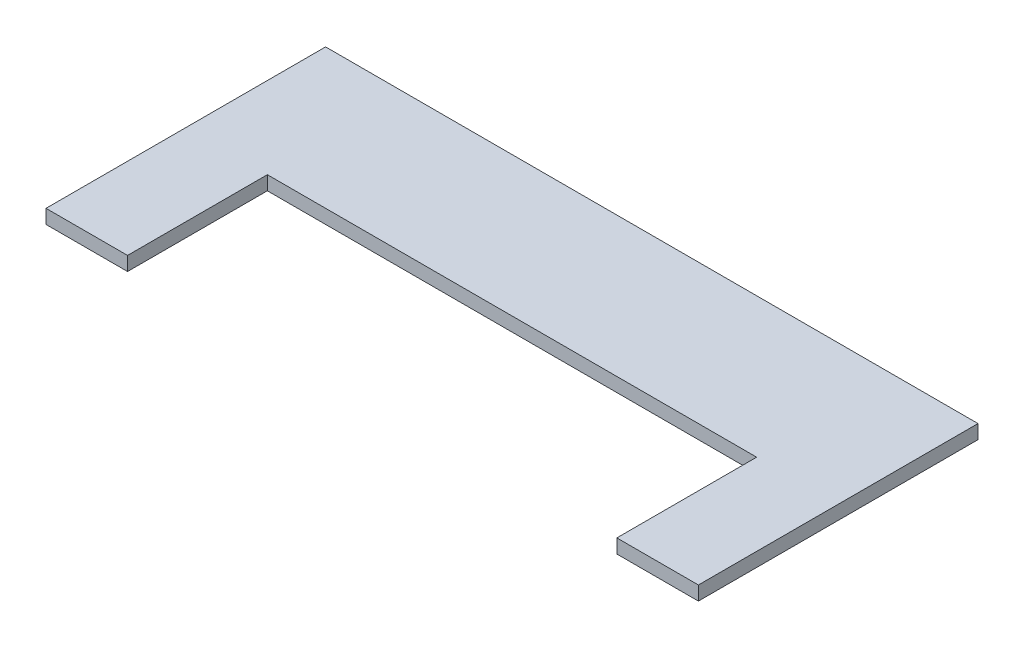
ISO-10303-21;
HEADER;
FILE_DESCRIPTION(('STEP AP214'),'2;1');
FILE_NAME('part.step','',(''),(''),'','','');
FILE_SCHEMA(('AUTOMOTIVE_DESIGN { 1 0 10303 214 1 1 1 1 }'));
ENDSEC;
DATA;
#1=APPLICATION_CONTEXT('core data for automotive mechanical design processes');
#2=APPLICATION_PROTOCOL_DEFINITION('international standard','automotive_design',2000,#1);
#3=PRODUCT_CONTEXT('',#1,'mechanical');
#4=PRODUCT('Part','Part','',(#3));
#5=PRODUCT_RELATED_PRODUCT_CATEGORY('part','',(#4));
#6=PRODUCT_DEFINITION_FORMATION('','',#4);
#7=PRODUCT_DEFINITION_CONTEXT('part definition',#1,'design');
#8=PRODUCT_DEFINITION('design','',#6,#7);
#9=PRODUCT_DEFINITION_SHAPE('','',#8);
#10=(LENGTH_UNIT() NAMED_UNIT(*) SI_UNIT(.MILLI.,.METRE.));
#11=(NAMED_UNIT(*) PLANE_ANGLE_UNIT() SI_UNIT($,.RADIAN.));
#12=(NAMED_UNIT(*) SI_UNIT($,.STERADIAN.) SOLID_ANGLE_UNIT());
#13=UNCERTAINTY_MEASURE_WITH_UNIT(LENGTH_MEASURE(1.E-05),#10,'distance_accuracy_value','');
#14=(GEOMETRIC_REPRESENTATION_CONTEXT(3) GLOBAL_UNCERTAINTY_ASSIGNED_CONTEXT((#13)) GLOBAL_UNIT_ASSIGNED_CONTEXT((#10,
#11,#12)) REPRESENTATION_CONTEXT('',''));
#15=CARTESIAN_POINT('',(0.,0.,0.));
#16=DIRECTION('',(0.,0.,1.));
#17=DIRECTION('',(1.,0.,0.));
#18=AXIS2_PLACEMENT_3D('',#15,#16,#17);
#19=CARTESIAN_POINT('',(0.,6.,0.));
#20=DIRECTION('',(0.,0.,-1.));
#21=DIRECTION('',(-1.,0.,0.));
#22=AXIS2_PLACEMENT_3D('',#19,#20,#21);
#23=PLANE('',#22);
#24=DIRECTION('',(1.,0.,0.));
#25=VECTOR('',#24,1.);
#26=CARTESIAN_POINT('',(0.,0.,0.));
#27=LINE('',#26,#25);
#28=CARTESIAN_POINT('',(0.,0.,0.));
#29=VERTEX_POINT('',#28);
#30=CARTESIAN_POINT('',(35.,0.,0.));
#31=VERTEX_POINT('',#30);
#32=EDGE_CURVE('E129',#29,#31,#27,.T.);
#33=ORIENTED_EDGE('',*,*,#32,.T.);
#34=DIRECTION('',(0.,-1.,0.));
#35=VECTOR('',#34,1.);
#36=CARTESIAN_POINT('',(35.,6.,0.));
#37=LINE('',#36,#35);
#38=CARTESIAN_POINT('',(35.,6.,0.));
#39=VERTEX_POINT('',#38);
#40=EDGE_CURVE('E11',#39,#31,#37,.T.);
#41=ORIENTED_EDGE('',*,*,#40,.F.);
#42=DIRECTION('',(1.,0.,0.));
#43=VECTOR('',#42,1.);
#44=CARTESIAN_POINT('',(0.,6.,0.));
#45=LINE('',#44,#43);
#46=CARTESIAN_POINT('',(0.,6.,0.));
#47=VERTEX_POINT('',#46);
#48=EDGE_CURVE('E143',#47,#39,#45,.T.);
#49=ORIENTED_EDGE('',*,*,#48,.F.);
#50=DIRECTION('',(0.,-1.,0.));
#51=VECTOR('',#50,1.);
#52=CARTESIAN_POINT('',(0.,6.,0.));
#53=LINE('',#52,#51);
#54=EDGE_CURVE('E125',#47,#29,#53,.T.);
#55=ORIENTED_EDGE('',*,*,#54,.T.);
#56=EDGE_LOOP('',(#33,#41,#49,#55));
#57=FACE_BOUND('',#56,.T.);
#58=ADVANCED_FACE('F33',(#57),#23,.F.);
#59=CARTESIAN_POINT('',(35.,6.,0.));
#60=DIRECTION('',(-1.,0.,0.));
#61=DIRECTION('',(0.,0.,1.));
#62=AXIS2_PLACEMENT_3D('',#59,#60,#61);
#63=PLANE('',#62);
#64=DIRECTION('',(0.,0.,-1.));
#65=VECTOR('',#64,1.);
#66=CARTESIAN_POINT('',(35.,0.,0.));
#67=LINE('',#66,#65);
#68=CARTESIAN_POINT('',(35.,0.,-60.));
#69=VERTEX_POINT('',#68);
#70=EDGE_CURVE('E132',#31,#69,#67,.T.);
#71=ORIENTED_EDGE('',*,*,#70,.T.);
#72=DIRECTION('',(0.,-1.,0.));
#73=VECTOR('',#72,1.);
#74=CARTESIAN_POINT('',(35.,6.,-60.));
#75=LINE('',#74,#73);
#76=CARTESIAN_POINT('',(35.,6.,-60.));
#77=VERTEX_POINT('',#76);
#78=EDGE_CURVE('E41',#77,#69,#75,.T.);
#79=ORIENTED_EDGE('',*,*,#78,.F.);
#80=DIRECTION('',(0.,0.,-1.));
#81=VECTOR('',#80,1.);
#82=CARTESIAN_POINT('',(35.,6.,0.));
#83=LINE('',#82,#81);
#84=EDGE_CURVE('E92',#39,#77,#83,.T.);
#85=ORIENTED_EDGE('',*,*,#84,.F.);
#86=ORIENTED_EDGE('',*,*,#40,.T.);
#87=EDGE_LOOP('',(#71,#79,#85,#86));
#88=FACE_BOUND('',#87,.T.);
#89=ADVANCED_FACE('F178',(#88),#63,.F.);
#90=CARTESIAN_POINT('',(35.,6.,-60.));
#91=DIRECTION('',(0.,0.,-1.));
#92=DIRECTION('',(-1.,0.,0.));
#93=AXIS2_PLACEMENT_3D('',#90,#91,#92);
#94=PLANE('',#93);
#95=DIRECTION('',(1.,0.,0.));
#96=VECTOR('',#95,1.);
#97=CARTESIAN_POINT('',(35.,0.,-60.));
#98=LINE('',#97,#96);
#99=CARTESIAN_POINT('',(245.,0.,-60.));
#100=VERTEX_POINT('',#99);
#101=EDGE_CURVE('E134',#69,#100,#98,.T.);
#102=ORIENTED_EDGE('',*,*,#101,.T.);
#103=DIRECTION('',(0.,-1.,0.));
#104=VECTOR('',#103,1.);
#105=CARTESIAN_POINT('',(245.,6.,-60.));
#106=LINE('',#105,#104);
#107=CARTESIAN_POINT('',(245.,6.,-60.));
#108=VERTEX_POINT('',#107);
#109=EDGE_CURVE('E150',#108,#100,#106,.T.);
#110=ORIENTED_EDGE('',*,*,#109,.F.);
#111=DIRECTION('',(1.,0.,0.));
#112=VECTOR('',#111,1.);
#113=CARTESIAN_POINT('',(35.,6.,-60.));
#114=LINE('',#113,#112);
#115=EDGE_CURVE('E158',#77,#108,#114,.T.);
#116=ORIENTED_EDGE('',*,*,#115,.F.);
#117=ORIENTED_EDGE('',*,*,#78,.T.);
#118=EDGE_LOOP('',(#102,#110,#116,#117));
#119=FACE_BOUND('',#118,.T.);
#120=ADVANCED_FACE('F156',(#119),#94,.F.);
#121=CARTESIAN_POINT('',(245.,6.,0.));
#122=DIRECTION('',(1.,0.,0.));
#123=DIRECTION('',(0.,0.,-1.));
#124=AXIS2_PLACEMENT_3D('',#121,#122,#123);
#125=PLANE('',#124);
#126=DIRECTION('',(0.,0.,1.));
#127=VECTOR('',#126,1.);
#128=CARTESIAN_POINT('',(245.,0.,0.));
#129=LINE('',#128,#127);
#130=CARTESIAN_POINT('',(245.,0.,0.));
#131=VERTEX_POINT('',#130);
#132=EDGE_CURVE('E136',#100,#131,#129,.T.);
#133=ORIENTED_EDGE('',*,*,#132,.T.);
#134=DIRECTION('',(0.,-1.,0.));
#135=VECTOR('',#134,1.);
#136=CARTESIAN_POINT('',(245.,6.,0.));
#137=LINE('',#136,#135);
#138=CARTESIAN_POINT('',(245.,6.,0.));
#139=VERTEX_POINT('',#138);
#140=EDGE_CURVE('E147',#139,#131,#137,.T.);
#141=ORIENTED_EDGE('',*,*,#140,.F.);
#142=DIRECTION('',(0.,0.,1.));
#143=VECTOR('',#142,1.);
#144=CARTESIAN_POINT('',(245.,6.,0.));
#145=LINE('',#144,#143);
#146=EDGE_CURVE('E170',#108,#139,#145,.T.);
#147=ORIENTED_EDGE('',*,*,#146,.F.);
#148=ORIENTED_EDGE('',*,*,#109,.T.);
#149=EDGE_LOOP('',(#133,#141,#147,#148));
#150=FACE_BOUND('',#149,.T.);
#151=ADVANCED_FACE('F166',(#150),#125,.F.);
#152=CARTESIAN_POINT('',(280.,6.,0.));
#153=DIRECTION('',(0.,0.,-1.));
#154=DIRECTION('',(-1.,0.,0.));
#155=AXIS2_PLACEMENT_3D('',#152,#153,#154);
#156=PLANE('',#155);
#157=DIRECTION('',(1.,0.,0.));
#158=VECTOR('',#157,1.);
#159=CARTESIAN_POINT('',(280.,0.,0.));
#160=LINE('',#159,#158);
#161=CARTESIAN_POINT('',(280.,0.,0.));
#162=VERTEX_POINT('',#161);
#163=EDGE_CURVE('E138',#131,#162,#160,.T.);
#164=ORIENTED_EDGE('',*,*,#163,.T.);
#165=DIRECTION('',(0.,-1.,0.));
#166=VECTOR('',#165,1.);
#167=CARTESIAN_POINT('',(280.,6.,0.));
#168=LINE('',#167,#166);
#169=CARTESIAN_POINT('',(280.,6.,0.));
#170=VERTEX_POINT('',#169);
#171=EDGE_CURVE('E120',#170,#162,#168,.T.);
#172=ORIENTED_EDGE('',*,*,#171,.F.);
#173=DIRECTION('',(1.,0.,0.));
#174=VECTOR('',#173,1.);
#175=CARTESIAN_POINT('',(280.,6.,0.));
#176=LINE('',#175,#174);
#177=EDGE_CURVE('E111',#139,#170,#176,.T.);
#178=ORIENTED_EDGE('',*,*,#177,.F.);
#179=ORIENTED_EDGE('',*,*,#140,.T.);
#180=EDGE_LOOP('',(#164,#172,#178,#179));
#181=FACE_BOUND('',#180,.T.);
#182=ADVANCED_FACE('F169',(#181),#156,.F.);
#183=CARTESIAN_POINT('',(280.,6.,-120.));
#184=DIRECTION('',(-1.,0.,0.));
#185=DIRECTION('',(0.,0.,1.));
#186=AXIS2_PLACEMENT_3D('',#183,#184,#185);
#187=PLANE('',#186);
#188=DIRECTION('',(0.,0.,-1.));
#189=VECTOR('',#188,1.);
#190=CARTESIAN_POINT('',(280.,0.,-120.));
#191=LINE('',#190,#189);
#192=CARTESIAN_POINT('',(280.,0.,-120.));
#193=VERTEX_POINT('',#192);
#194=EDGE_CURVE('E119',#162,#193,#191,.T.);
#195=ORIENTED_EDGE('',*,*,#194,.T.);
#196=DIRECTION('',(0.,-1.,0.));
#197=VECTOR('',#196,1.);
#198=CARTESIAN_POINT('',(280.,6.,-120.));
#199=LINE('',#198,#197);
#200=CARTESIAN_POINT('',(280.,6.,-120.));
#201=VERTEX_POINT('',#200);
#202=EDGE_CURVE('E116',#201,#193,#199,.T.);
#203=ORIENTED_EDGE('',*,*,#202,.F.);
#204=DIRECTION('',(0.,0.,-1.));
#205=VECTOR('',#204,1.);
#206=CARTESIAN_POINT('',(280.,6.,-120.));
#207=LINE('',#206,#205);
#208=EDGE_CURVE('E105',#170,#201,#207,.T.);
#209=ORIENTED_EDGE('',*,*,#208,.F.);
#210=ORIENTED_EDGE('',*,*,#171,.T.);
#211=EDGE_LOOP('',(#195,#203,#209,#210));
#212=FACE_BOUND('',#211,.T.);
#213=ADVANCED_FACE('F117',(#212),#187,.F.);
#214=CARTESIAN_POINT('',(0.,6.,-120.));
#215=DIRECTION('',(0.,0.,1.));
#216=DIRECTION('',(1.,0.,0.));
#217=AXIS2_PLACEMENT_3D('',#214,#215,#216);
#218=PLANE('',#217);
#219=DIRECTION('',(-1.,0.,0.));
#220=VECTOR('',#219,1.);
#221=CARTESIAN_POINT('',(0.,0.,-120.));
#222=LINE('',#221,#220);
#223=CARTESIAN_POINT('',(0.,0.,-120.));
#224=VERTEX_POINT('',#223);
#225=EDGE_CURVE('E78',#193,#224,#222,.T.);
#226=ORIENTED_EDGE('',*,*,#225,.T.);
#227=DIRECTION('',(0.,-1.,0.));
#228=VECTOR('',#227,1.);
#229=CARTESIAN_POINT('',(0.,6.,-120.));
#230=LINE('',#229,#228);
#231=CARTESIAN_POINT('',(0.,6.,-120.));
#232=VERTEX_POINT('',#231);
#233=EDGE_CURVE('E121',#232,#224,#230,.T.);
#234=ORIENTED_EDGE('',*,*,#233,.F.);
#235=DIRECTION('',(-1.,0.,0.));
#236=VECTOR('',#235,1.);
#237=CARTESIAN_POINT('',(0.,6.,-120.));
#238=LINE('',#237,#236);
#239=EDGE_CURVE('E109',#201,#232,#238,.T.);
#240=ORIENTED_EDGE('',*,*,#239,.F.);
#241=ORIENTED_EDGE('',*,*,#202,.T.);
#242=EDGE_LOOP('',(#226,#234,#240,#241));
#243=FACE_BOUND('',#242,.T.);
#244=ADVANCED_FACE('F123',(#243),#218,.F.);
#245=CARTESIAN_POINT('',(0.,6.,0.));
#246=DIRECTION('',(1.,0.,0.));
#247=DIRECTION('',(0.,0.,-1.));
#248=AXIS2_PLACEMENT_3D('',#245,#246,#247);
#249=PLANE('',#248);
#250=DIRECTION('',(0.,0.,1.));
#251=VECTOR('',#250,1.);
#252=CARTESIAN_POINT('',(0.,0.,0.));
#253=LINE('',#252,#251);
#254=EDGE_CURVE('E84',#224,#29,#253,.T.);
#255=ORIENTED_EDGE('',*,*,#254,.T.);
#256=ORIENTED_EDGE('',*,*,#54,.F.);
#257=DIRECTION('',(0.,0.,1.));
#258=VECTOR('',#257,1.);
#259=CARTESIAN_POINT('',(0.,6.,0.));
#260=LINE('',#259,#258);
#261=EDGE_CURVE('E49',#232,#47,#260,.T.);
#262=ORIENTED_EDGE('',*,*,#261,.F.);
#263=ORIENTED_EDGE('',*,*,#233,.T.);
#264=EDGE_LOOP('',(#255,#256,#262,#263));
#265=FACE_BOUND('',#264,.T.);
#266=ADVANCED_FACE('F194',(#265),#249,.F.);
#267=CARTESIAN_POINT('',(0.,6.,0.));
#268=DIRECTION('',(0.,1.,0.));
#269=DIRECTION('',(0.,0.,1.));
#270=AXIS2_PLACEMENT_3D('',#267,#268,#269);
#271=PLANE('',#270);
#272=ORIENTED_EDGE('',*,*,#48,.T.);
#273=ORIENTED_EDGE('',*,*,#84,.T.);
#274=ORIENTED_EDGE('',*,*,#115,.T.);
#275=ORIENTED_EDGE('',*,*,#146,.T.);
#276=ORIENTED_EDGE('',*,*,#177,.T.);
#277=ORIENTED_EDGE('',*,*,#208,.T.);
#278=ORIENTED_EDGE('',*,*,#239,.T.);
#279=ORIENTED_EDGE('',*,*,#261,.T.);
#280=EDGE_LOOP('',(#272,#273,#274,#275,#276,#277,#278,#279));
#281=FACE_BOUND('',#280,.T.);
#282=ADVANCED_FACE('F107',(#281),#271,.T.);
#283=CARTESIAN_POINT('',(0.,0.,0.));
#284=DIRECTION('',(0.,1.,0.));
#285=DIRECTION('',(0.,0.,1.));
#286=AXIS2_PLACEMENT_3D('',#283,#284,#285);
#287=PLANE('',#286);
#288=ORIENTED_EDGE('',*,*,#32,.F.);
#289=ORIENTED_EDGE('',*,*,#254,.F.);
#290=ORIENTED_EDGE('',*,*,#225,.F.);
#291=ORIENTED_EDGE('',*,*,#194,.F.);
#292=ORIENTED_EDGE('',*,*,#163,.F.);
#293=ORIENTED_EDGE('',*,*,#132,.F.);
#294=ORIENTED_EDGE('',*,*,#101,.F.);
#295=ORIENTED_EDGE('',*,*,#70,.F.);
#296=EDGE_LOOP('',(#288,#289,#290,#291,#292,#293,#294,#295));
#297=FACE_BOUND('',#296,.T.);
#298=ADVANCED_FACE('F162',(#297),#287,.F.);
#299=CLOSED_SHELL('',(#58,#89,#120,#151,#182,#213,#244,#266,#282,#298));
#300=MANIFOLD_SOLID_BREP('B2',#299);
#301=ADVANCED_BREP_SHAPE_REPRESENTATION('',(#18,#300),#14);
#302=SHAPE_DEFINITION_REPRESENTATION(#9,#301);
ENDSEC;
END-ISO-10303-21;
